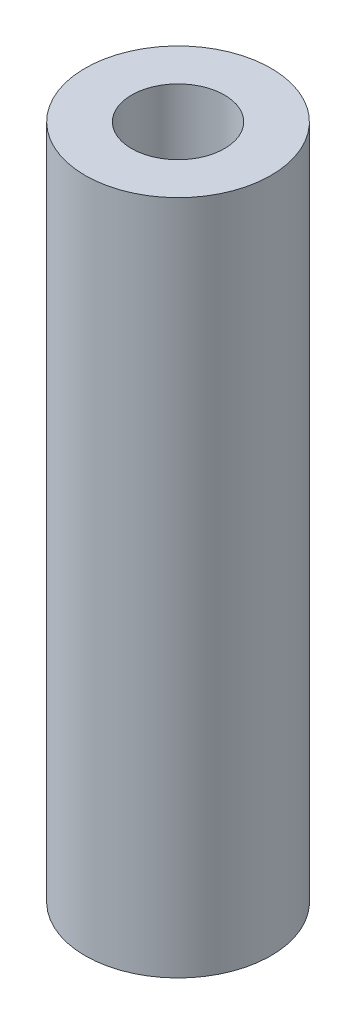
from build123d import *

# Parameters (mm, degrees)
SKETCH1_R           = 11
SKETCH1_R_2         = 5.5
BOSS_EXTRUDE1_DEPTH = 40


with BuildPart() as part:
    # Sketch1 → Boss-Extrude1 (new, symmetric)
    with BuildSketch(Plane(origin=(0, 0, 0), x_dir=(1, 0, 0), z_dir=(0, 1, 0))):
        with Locations(Location((0, 0, 0), (0, 0, 270))):
            Circle(SKETCH1_R)
        with Locations(Location((0, 0, 0), (0, 0, 270))):
            Circle(SKETCH1_R_2, mode=Mode.SUBTRACT)
    extrude(amount=BOSS_EXTRUDE1_DEPTH, both=True)


solid = part.part
